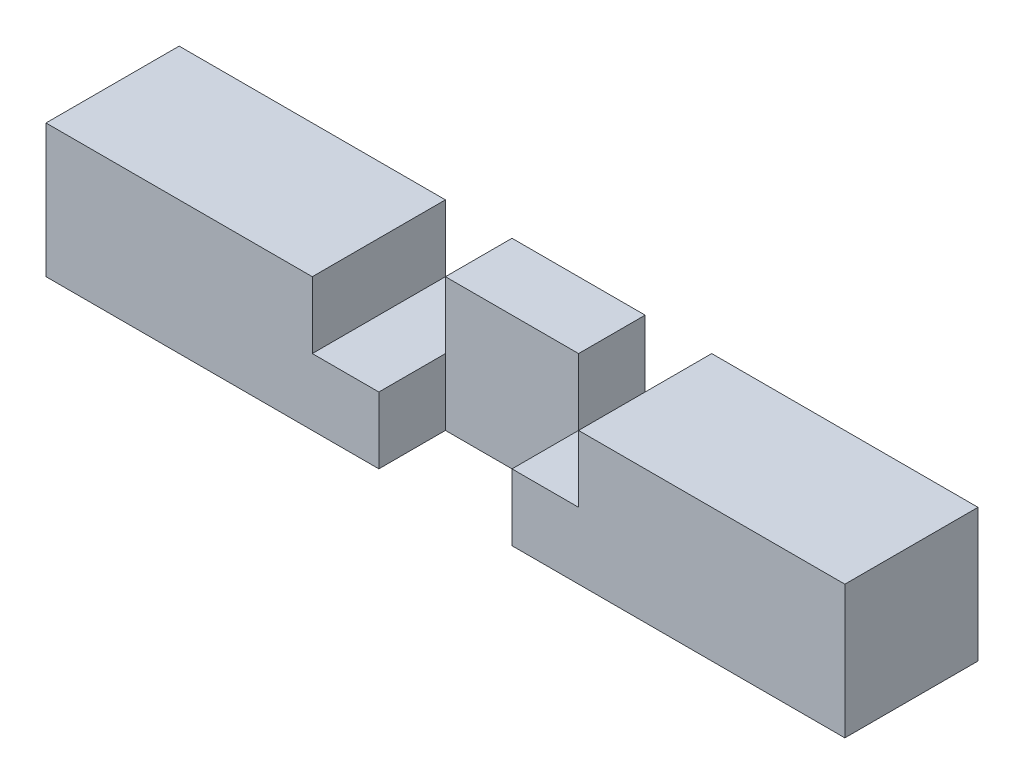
from build123d import *

# Parameters (mm, degrees)
SKETCH1_W      = 120
SKETCH1_H      = 20
EXTRUDE1_DEPTH = 20
SKETCH2_W      = 10
SKETCH2_H      = 10
EXTRUDE2_DEPTH = 124.288280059
SKETCH3_W      = 20
SKETCH3_H      = 10
EXTRUDE3_DEPTH = 124.288280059


with BuildPart() as part:
    # Sketch1 → Extrude1 (new body)
    with BuildSketch(Plane(origin=(0, 0, 0), x_dir=(1, 0, 0), z_dir=(0, 1, 0))):
        with Locations((60, 10)):
            Rectangle(SKETCH1_W, SKETCH1_H)
    extrude(amount=EXTRUDE1_DEPTH)

    # Sketch2 → Extrude2 (cut, through all)
    with BuildSketch(Plane.XY):
        with Locations((45, 15)):
            Rectangle(SKETCH2_W, SKETCH2_H)
        with Locations((75, 15)):
            Rectangle(SKETCH2_W, SKETCH2_H)
    extrude(amount=-EXTRUDE2_DEPTH, mode=Mode.SUBTRACT)

    # Sketch3 → Extrude3 (cut, through all)
    with BuildSketch(Plane(origin=(0, 20, 0), x_dir=(1, 0, 0), z_dir=(0, 1, 0))):
        with Locations((60, 5)):
            Rectangle(SKETCH3_W, SKETCH3_H)
    extrude(amount=-EXTRUDE3_DEPTH, mode=Mode.SUBTRACT)


solid = part.part
